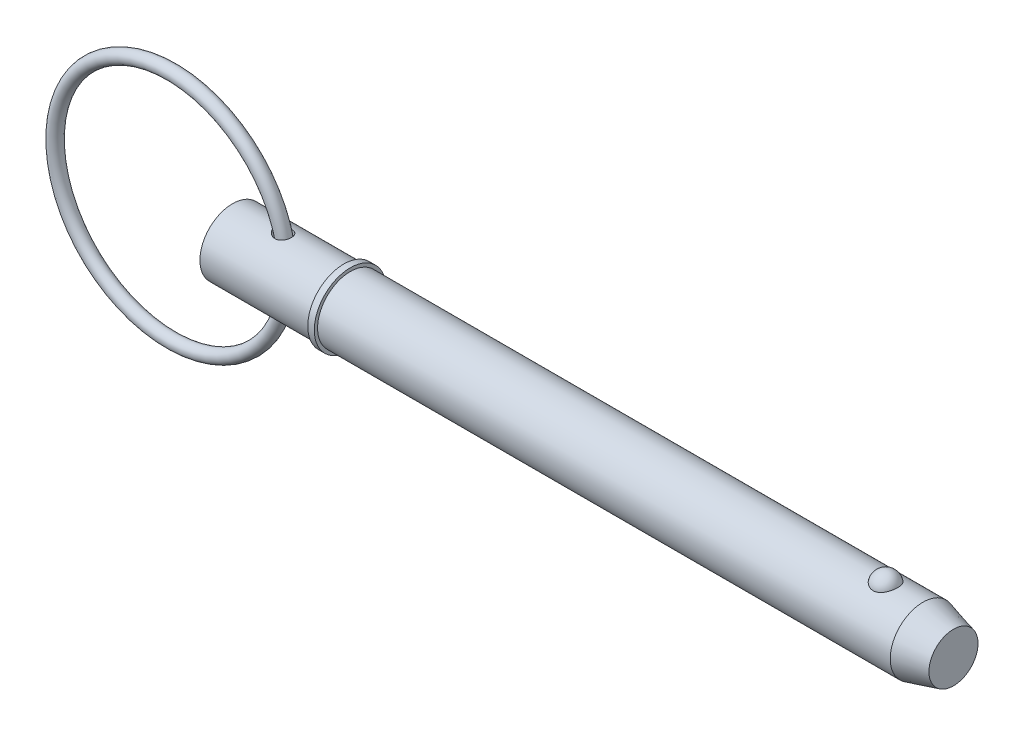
ISO-10303-21;
HEADER;
FILE_DESCRIPTION(('STEP AP214'),'2;1');
FILE_NAME('part.step','',(''),(''),'','','');
FILE_SCHEMA(('AUTOMOTIVE_DESIGN { 1 0 10303 214 1 1 1 1 }'));
ENDSEC;
DATA;
#1=APPLICATION_CONTEXT('core data for automotive mechanical design processes');
#2=APPLICATION_PROTOCOL_DEFINITION('international standard','automotive_design',2000,#1);
#3=PRODUCT_CONTEXT('',#1,'mechanical');
#4=PRODUCT('Part','Part','',(#3));
#5=PRODUCT_RELATED_PRODUCT_CATEGORY('part','',(#4));
#6=PRODUCT_DEFINITION_FORMATION('','',#4);
#7=PRODUCT_DEFINITION_CONTEXT('part definition',#1,'design');
#8=PRODUCT_DEFINITION('design','',#6,#7);
#9=PRODUCT_DEFINITION_SHAPE('','',#8);
#10=(LENGTH_UNIT() NAMED_UNIT(*) SI_UNIT(.MILLI.,.METRE.));
#11=(NAMED_UNIT(*) PLANE_ANGLE_UNIT() SI_UNIT($,.RADIAN.));
#12=(NAMED_UNIT(*) SI_UNIT($,.STERADIAN.) SOLID_ANGLE_UNIT());
#13=UNCERTAINTY_MEASURE_WITH_UNIT(LENGTH_MEASURE(1.E-05),#10,'distance_accuracy_value','');
#14=(GEOMETRIC_REPRESENTATION_CONTEXT(3) GLOBAL_UNCERTAINTY_ASSIGNED_CONTEXT((#13)) GLOBAL_UNIT_ASSIGNED_CONTEXT((#10,
#11,#12)) REPRESENTATION_CONTEXT('',''));
#15=CARTESIAN_POINT('',(0.,0.,0.));
#16=DIRECTION('',(0.,0.,1.));
#17=DIRECTION('',(1.,0.,0.));
#18=AXIS2_PLACEMENT_3D('',#15,#16,#17);
#19=CARTESIAN_POINT('',(-13.3805387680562,0.,0.));
#20=DIRECTION('',(0.,0.,1.));
#21=DIRECTION('',(1.,0.,0.));
#22=AXIS2_PLACEMENT_3D('',#19,#20,#21);
#23=TOROIDAL_SURFACE('',#22,25.4,1.429);
#24=CARTESIAN_POINT('',(13.4484612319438,0.,0.));
#25=VERTEX_POINT('',#24);
#26=VERTEX_LOOP('',#25);
#27=FACE_BOUND('',#26,.T.);
#28=ADVANCED_FACE('P0_F12',(#27),#23,.T.);
#29=CLOSED_SHELL('',(#28));
#30=MANIFOLD_SOLID_BREP('P0_B1',#29);
#31=CARTESIAN_POINT('',(0.,0.,0.));
#32=DIRECTION('',(1.,0.,0.));
#33=DIRECTION('',(0.,0.,-1.));
#34=AXIS2_PLACEMENT_3D('',#31,#32,#33);
#35=CYLINDRICAL_SURFACE('',#34,7.145);
#36=CARTESIAN_POINT('',(9.43029029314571,7.0820748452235,-0.946171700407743));
#37=CARTESIAN_POINT('',(9.49289741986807,7.07004660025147,-1.03619677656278));
#38=CARTESIAN_POINT('',(9.56370593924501,7.05703049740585,-1.12049617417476));
#39=CARTESIAN_POINT('',(9.71869321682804,7.03060933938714,-1.27585605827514));
#40=CARTESIAN_POINT('',(9.80290151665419,7.01720347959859,-1.34688652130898));
#41=CARTESIAN_POINT('',(9.98160385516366,6.99158714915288,-1.47408585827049));
#42=CARTESIAN_POINT('',(10.0760626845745,6.97937284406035,-1.53030346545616));
#43=CARTESIAN_POINT('',(10.2729508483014,6.95747410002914,-1.62697341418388));
#44=CARTESIAN_POINT('',(10.3753769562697,6.9477886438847,-1.66743209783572));
#45=CARTESIAN_POINT('',(10.5898946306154,6.93181594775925,-1.73266776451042));
#46=CARTESIAN_POINT('',(10.7022085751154,6.92567913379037,-1.75675727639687));
#47=CARTESIAN_POINT('',(10.9294935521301,6.91839634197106,-1.78523005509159));
#48=CARTESIAN_POINT('',(11.0444638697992,6.91724903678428,-1.78961856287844));
#49=CARTESIAN_POINT('',(11.2673249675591,6.92023954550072,-1.77801517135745));
#50=CARTESIAN_POINT('',(11.3752729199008,6.9241055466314,-1.7630715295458));
#51=CARTESIAN_POINT('',(11.5865707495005,6.93632220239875,-1.71437618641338));
#52=CARTESIAN_POINT('',(11.6899227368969,6.94467077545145,-1.68063321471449));
#53=CARTESIAN_POINT('',(11.8814537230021,6.96412118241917,-1.59802791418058));
#54=CARTESIAN_POINT('',(11.9701885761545,6.97498839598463,-1.55039425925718));
#55=CARTESIAN_POINT('',(12.1379548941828,6.99847346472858,-1.44066970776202));
#56=CARTESIAN_POINT('',(12.216987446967,7.01109112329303,-1.37858043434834));
#57=CARTESIAN_POINT('',(12.3614636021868,7.03632910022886,-1.24326778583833));
#58=CARTESIAN_POINT('',(12.4271729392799,7.04894297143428,-1.17032635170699));
#59=CARTESIAN_POINT('',(12.5455377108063,7.07306867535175,-1.01436746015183));
#60=CARTESIAN_POINT('',(12.5981928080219,7.08458047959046,-0.931349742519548));
#61=CARTESIAN_POINT('',(12.6896059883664,7.10535787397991,-0.75677050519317));
#62=CARTESIAN_POINT('',(12.7282356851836,7.11460247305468,-0.665139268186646));
#63=CARTESIAN_POINT('',(12.7900431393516,7.12971795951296,-0.476541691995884));
#64=CARTESIAN_POINT('',(12.8132203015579,7.13558871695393,-0.379575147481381));
#65=CARTESIAN_POINT('',(12.843715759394,7.14336270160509,-0.182249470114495));
#66=CARTESIAN_POINT('',(12.8509095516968,7.14523477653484,-0.0818698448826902));
#67=CARTESIAN_POINT('',(12.8489064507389,7.14471772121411,0.11871563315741));
#68=CARTESIAN_POINT('',(12.8397092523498,7.14232851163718,0.218921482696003));
#69=CARTESIAN_POINT('',(12.8051110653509,7.13353949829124,0.416446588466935));
#70=CARTESIAN_POINT('',(12.7796895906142,7.12713462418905,0.51376203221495));
#71=CARTESIAN_POINT('',(12.7132079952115,7.1110024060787,0.702607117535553));
#72=CARTESIAN_POINT('',(12.6721476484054,7.10127501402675,0.794136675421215));
#73=CARTESIAN_POINT('',(12.5754142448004,7.07957648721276,0.9686879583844));
#74=CARTESIAN_POINT('',(12.5197583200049,7.06760798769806,1.05171950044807));
#75=CARTESIAN_POINT('',(12.3951873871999,7.04275315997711,1.20699878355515));
#76=CARTESIAN_POINT('',(12.3262733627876,7.02986689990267,1.27924732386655));
#77=CARTESIAN_POINT('',(12.1775943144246,7.00473797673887,1.41035599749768));
#78=CARTESIAN_POINT('',(12.0979195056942,6.99249102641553,1.46931758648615));
#79=CARTESIAN_POINT('',(11.9295314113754,6.96991222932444,1.57295053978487));
#80=CARTESIAN_POINT('',(11.840819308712,6.9595801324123,1.61762377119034));
#81=CARTESIAN_POINT('',(11.6577653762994,6.94204625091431,1.69128599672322));
#82=CARTESIAN_POINT('',(11.5634812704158,6.93481718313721,1.72041226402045));
#83=CARTESIAN_POINT('',(11.3712731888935,6.92407027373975,1.76316901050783));
#84=CARTESIAN_POINT('',(11.2733489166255,6.92055273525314,1.7767982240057));
#85=CARTESIAN_POINT('',(11.0745092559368,6.91745053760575,1.78883853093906));
#86=CARTESIAN_POINT('',(10.9735737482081,6.91794816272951,1.7869312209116));
#87=CARTESIAN_POINT('',(10.7732766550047,6.92286647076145,1.76777696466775));
#88=CARTESIAN_POINT('',(10.6739155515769,6.92728833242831,1.75052540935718));
#89=CARTESIAN_POINT('',(10.4726907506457,6.93987626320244,1.69995986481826));
#90=CARTESIAN_POINT('',(10.3710860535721,6.94826759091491,1.66567223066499));
#91=CARTESIAN_POINT('',(10.1746512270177,6.96783543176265,1.5818155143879));
#92=CARTESIAN_POINT('',(10.0798244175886,6.97901329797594,1.53223900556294));
#93=CARTESIAN_POINT('',(9.89353725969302,7.00369413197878,1.41530336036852));
#94=CARTESIAN_POINT('',(9.80266896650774,7.01729943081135,1.34701798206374));
#95=CARTESIAN_POINT('',(9.63408859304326,7.0446567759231,1.19571433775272));
#96=CARTESIAN_POINT('',(9.55637809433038,7.05840883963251,1.11269430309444));
#97=CARTESIAN_POINT('',(9.41909992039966,7.083998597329,0.935821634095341));
#98=CARTESIAN_POINT('',(9.3591283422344,7.09587546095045,0.842290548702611));
#99=CARTESIAN_POINT('',(9.25811978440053,7.11649414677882,0.645207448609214));
#100=CARTESIAN_POINT('',(9.2170578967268,7.12524008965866,0.541668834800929));
#101=CARTESIAN_POINT('',(9.16044503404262,7.13745944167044,0.341322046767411));
#102=CARTESIAN_POINT('',(9.14237352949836,7.14144984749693,0.24525723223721));
#103=CARTESIAN_POINT('',(9.12416132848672,7.14547143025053,0.0513577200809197));
#104=CARTESIAN_POINT('',(9.12401221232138,7.14550446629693,-0.0464761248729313));
#105=CARTESIAN_POINT('',(9.14075660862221,7.14180686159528,-0.230866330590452));
#106=CARTESIAN_POINT('',(9.15598246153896,7.13844450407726,-0.317588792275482));
#107=CARTESIAN_POINT('',(9.20015637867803,7.1288735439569,-0.487231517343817));
#108=CARTESIAN_POINT('',(9.22909411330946,7.12266708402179,-0.570154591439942));
#109=CARTESIAN_POINT('',(9.2869632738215,7.11060500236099,-0.702183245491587));
#110=CARTESIAN_POINT('',(9.31233771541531,7.10538970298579,-0.752949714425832));
#111=CARTESIAN_POINT('',(9.36784352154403,7.09422889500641,-0.85170964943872));
#112=CARTESIAN_POINT('',(9.39797435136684,7.08828346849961,-0.899703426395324));
#113=CARTESIAN_POINT('',(9.43029029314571,7.0820748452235,-0.946171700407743));
#114=B_SPLINE_CURVE_WITH_KNOTS('',3,(#36,#37,#38,#39,#40,#41,#42,#43,#44,#45,#46,#47,#48,#49,
#50,#51,#52,#53,#54,#55,#56,#57,#58,#59,#60,#61,#62,#63,#64,#65,#66,#67,#68,#69,#70,#71,#72,#73,
#74,#75,#76,#77,#78,#79,#80,#81,#82,#83,#84,#85,#86,#87,#88,#89,#90,#91,#92,#93,#94,#95,#96,#97,
#98,#99,#100,#101,#102,#103,#104,#105,#106,#107,#108,#109,#110,#111,#112,#113),.UNSPECIFIED.,
.T.,.F.,(4,2,2,2,2,2,2,2,2,2,2,2,2,2,2,2,2,2,2,2,2,2,2,2,2,2,2,2,2,2,2,2,2,2,2,2,2,2,4),(0.,
0.330712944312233,0.662165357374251,0.992513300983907,1.32272815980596,1.66607248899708,
2.00932547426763,2.33472339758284,2.65997034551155,2.96236844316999,3.26473260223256,
3.56029376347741,3.85586255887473,4.15407251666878,4.45229395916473,4.75283038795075,
5.05337241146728,5.35429467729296,5.6552212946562,5.95579625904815,6.25634893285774,
6.55452242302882,6.85265693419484,7.14811357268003,7.44359434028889,7.74514565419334,
8.04678757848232,8.368090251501,8.68954924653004,9.03133562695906,9.37316306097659,
9.70647113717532,10.0393389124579,10.3311793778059,10.6228827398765,10.8860177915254,
11.1489549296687,11.3196783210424,11.4903825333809),.UNSPECIFIED.);
#115=CARTESIAN_POINT('',(9.43029029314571,7.0820748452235,-0.946171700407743));
#116=VERTEX_POINT('',#115);
#117=EDGE_CURVE('P1_E42',#116,#116,#114,.T.);
#118=ORIENTED_EDGE('',*,*,#117,.T.);
#119=EDGE_LOOP('',(#118));
#120=FACE_BOUND('',#119,.T.);
#121=CARTESIAN_POINT('',(0.,0.,0.));
#122=DIRECTION('',(1.,0.,0.));
#123=DIRECTION('',(0.,0.,-1.));
#124=AXIS2_PLACEMENT_3D('',#121,#122,#123);
#125=CIRCLE('',#124,7.145);
#126=CARTESIAN_POINT('',(0.,0.,-7.145));
#127=VERTEX_POINT('',#126);
#128=EDGE_CURVE('P1_E9',#127,#127,#125,.T.);
#129=ORIENTED_EDGE('',*,*,#128,.T.);
#130=EDGE_LOOP('',(#129));
#131=FACE_BOUND('',#130,.T.);
#132=CARTESIAN_POINT('',(24.271,0.,0.));
#133=DIRECTION('',(1.,0.,0.));
#134=DIRECTION('',(0.,0.,-1.));
#135=AXIS2_PLACEMENT_3D('',#132,#133,#134);
#136=CIRCLE('',#135,7.145);
#137=CARTESIAN_POINT('',(24.271,0.,-7.145));
#138=VERTEX_POINT('',#137);
#139=EDGE_CURVE('P1_E25',#138,#138,#136,.T.);
#140=ORIENTED_EDGE('',*,*,#139,.F.);
#141=EDGE_LOOP('',(#140));
#142=FACE_BOUND('',#141,.T.);
#143=CARTESIAN_POINT('',(9.43029029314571,-7.0820748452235,-0.946171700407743));
#144=CARTESIAN_POINT('',(9.37760063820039,-7.09219753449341,-0.870403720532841));
#145=CARTESIAN_POINT('',(9.33068640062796,-7.10162619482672,-0.790535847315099));
#146=CARTESIAN_POINT('',(9.25028000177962,-7.11818229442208,-0.624083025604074));
#147=CARTESIAN_POINT('',(9.21677847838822,-7.12531133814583,-0.537502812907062));
#148=CARTESIAN_POINT('',(9.16475883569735,-7.13651886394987,-0.359324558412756));
#149=CARTESIAN_POINT('',(9.14630423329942,-7.14058440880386,-0.267706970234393));
#150=CARTESIAN_POINT('',(9.12573334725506,-7.14512216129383,-0.0825612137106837));
#151=CARTESIAN_POINT('',(9.12361335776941,-7.1455951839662,0.0109665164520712));
#152=CARTESIAN_POINT('',(9.13548667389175,-7.14296952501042,0.191627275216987));
#153=CARTESIAN_POINT('',(9.14858103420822,-7.14007009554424,0.278824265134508));
#154=CARTESIAN_POINT('',(9.18869656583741,-7.1313430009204,0.449782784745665));
#155=CARTESIAN_POINT('',(9.21571947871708,-7.1255149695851,0.533543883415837));
#156=CARTESIAN_POINT('',(9.282939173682,-7.11140544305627,0.696984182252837));
#157=CARTESIAN_POINT('',(9.32334793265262,-7.10308469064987,0.7765721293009));
#158=CARTESIAN_POINT('',(9.41555290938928,-7.08481187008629,0.928623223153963));
#159=CARTESIAN_POINT('',(9.4673531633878,-7.07485922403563,1.00108383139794));
#160=CARTESIAN_POINT('',(9.58690514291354,-7.05302654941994,1.14530893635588));
#161=CARTESIAN_POINT('',(9.65578345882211,-7.04105486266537,1.21612477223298));
#162=CARTESIAN_POINT('',(9.80342908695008,-7.01727063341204,1.34660507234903));
#163=CARTESIAN_POINT('',(9.88220203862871,-7.00545818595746,1.40626312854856));
#164=CARTESIAN_POINT('',(10.0573217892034,-6.98177399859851,1.51973713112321));
#165=CARTESIAN_POINT('',(10.1546474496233,-6.9700532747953,1.57208037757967));
#166=CARTESIAN_POINT('',(10.3567277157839,-6.94950828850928,1.66055104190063));
#167=CARTESIAN_POINT('',(10.4614845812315,-6.94068491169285,1.69667350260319));
#168=CARTESIAN_POINT('',(10.6792116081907,-6.92685379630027,1.75230777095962));
#169=CARTESIAN_POINT('',(10.7923373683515,-6.92197732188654,1.77125049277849));
#170=CARTESIAN_POINT('',(11.0202699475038,-6.91736328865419,1.78919210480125));
#171=CARTESIAN_POINT('',(11.1350759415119,-6.91762328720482,1.78820047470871));
#172=CARTESIAN_POINT('',(11.355627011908,-6.92328130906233,1.76615765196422));
#173=CARTESIAN_POINT('',(11.4615007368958,-6.92836826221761,1.74632083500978));
#174=CARTESIAN_POINT('',(11.6678083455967,-6.94272508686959,1.68833625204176));
#175=CARTESIAN_POINT('',(11.7682443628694,-6.9519933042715,1.65019572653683));
#176=CARTESIAN_POINT('',(11.9539217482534,-6.97285816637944,1.55957439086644));
#177=CARTESIAN_POINT('',(12.0397280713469,-6.98426147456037,1.50820229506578));
#178=CARTESIAN_POINT('',(12.2011249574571,-7.00842344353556,1.39160266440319));
#179=CARTESIAN_POINT('',(12.276716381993,-7.0211819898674,1.32637629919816));
#180=CARTESIAN_POINT('',(12.4144868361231,-7.04639315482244,1.18508369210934));
#181=CARTESIAN_POINT('',(12.4768620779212,-7.05884739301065,1.10920872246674));
#182=CARTESIAN_POINT('',(12.5881779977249,-7.08230185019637,0.947973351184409));
#183=CARTESIAN_POINT('',(12.6371182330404,-7.09330202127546,0.862612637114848));
#184=CARTESIAN_POINT('',(12.7208404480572,-7.11277016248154,0.68387168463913));
#185=CARTESIAN_POINT('',(12.7554736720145,-7.12121129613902,0.590418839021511));
#186=CARTESIAN_POINT('',(12.8090653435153,-7.13450309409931,0.398877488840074));
#187=CARTESIAN_POINT('',(12.8280232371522,-7.13935363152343,0.300788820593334));
#188=CARTESIAN_POINT('',(12.8499077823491,-7.14496695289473,0.102058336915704));
#189=CARTESIAN_POINT('',(12.8527265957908,-7.14570223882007,0.00140385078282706));
#190=CARTESIAN_POINT('',(12.8419792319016,-7.14293198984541,-0.198968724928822));
#191=CARTESIAN_POINT('',(12.8284127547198,-7.13942637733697,-0.298686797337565));
#192=CARTESIAN_POINT('',(12.7851853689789,-7.12854635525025,-0.494442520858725));
#193=CARTESIAN_POINT('',(12.7555107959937,-7.12116866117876,-0.590476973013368));
#194=CARTESIAN_POINT('',(12.6807437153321,-7.10334272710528,-0.776042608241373));
#195=CARTESIAN_POINT('',(12.6356510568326,-7.09289445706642,-0.865573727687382));
#196=CARTESIAN_POINT('',(12.5312128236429,-7.07009703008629,-1.03541867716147));
#197=CARTESIAN_POINT('',(12.4718917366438,-7.0577511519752,-1.11574799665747));
#198=CARTESIAN_POINT('',(12.3404461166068,-7.03252701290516,-1.26504204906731));
#199=CARTESIAN_POINT('',(12.2683227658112,-7.01964880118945,-1.3340078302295));
#200=CARTESIAN_POINT('',(12.1139052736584,-6.99493588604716,-1.45803732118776));
#201=CARTESIAN_POINT('',(12.031708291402,-6.98309284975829,-1.51322032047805));
#202=CARTESIAN_POINT('',(11.858962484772,-6.96164945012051,-1.60900039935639));
#203=CARTESIAN_POINT('',(11.7684146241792,-6.95204882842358,-1.6495991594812));
#204=CARTESIAN_POINT('',(11.5822744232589,-6.93618392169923,-1.71508374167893));
#205=CARTESIAN_POINT('',(11.4867225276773,-6.92989640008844,-1.74007923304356));
#206=CARTESIAN_POINT('',(11.292703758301,-6.92114809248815,-1.77455680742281));
#207=CARTESIAN_POINT('',(11.1942365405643,-6.91868775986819,-1.7840370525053));
#208=CARTESIAN_POINT('',(10.9943797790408,-6.91771041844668,-1.78782317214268));
#209=CARTESIAN_POINT('',(10.8929824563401,-6.9193005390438,-1.78171679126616));
#210=CARTESIAN_POINT('',(10.6924353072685,-6.92632816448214,-1.75419409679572));
#211=CARTESIAN_POINT('',(10.5932861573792,-6.93176681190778,-1.73277323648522));
#212=CARTESIAN_POINT('',(10.3927770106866,-6.94630717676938,-1.67356884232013));
#213=CARTESIAN_POINT('',(10.2917367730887,-6.95563581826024,-1.63475796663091));
#214=CARTESIAN_POINT('',(10.0971768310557,-6.97681957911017,-1.54184188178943));
#215=CARTESIAN_POINT('',(10.0036623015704,-6.9886764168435,-1.48772626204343));
#216=CARTESIAN_POINT('',(9.82098935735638,-7.01440230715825,-1.36146688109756));
#217=CARTESIAN_POINT('',(9.73247440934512,-7.0283510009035,-1.28840361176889));
#218=CARTESIAN_POINT('',(9.56978695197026,-7.05591334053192,-1.12770855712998));
#219=CARTESIAN_POINT('',(9.49560170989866,-7.06952727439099,-1.0400898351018));
#220=CARTESIAN_POINT('',(9.43029029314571,-7.0820748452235,-0.946171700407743));
#221=B_SPLINE_CURVE_WITH_KNOTS('',3,(#143,#144,#145,#146,#147,#148,#149,#150,#151,#152,#153,
#154,#155,#156,#157,#158,#159,#160,#161,#162,#163,#164,#165,#166,#167,#168,#169,#170,#171,#172,
#173,#174,#175,#176,#177,#178,#179,#180,#181,#182,#183,#184,#185,#186,#187,#188,#189,#190,#191,
#192,#193,#194,#195,#196,#197,#198,#199,#200,#201,#202,#203,#204,#205,#206,#207,#208,#209,#210,
#211,#212,#213,#214,#215,#216,#217,#218,#219,#220),.UNSPECIFIED.,.T.,.F.,(4,2,2,2,2,2,2,2,2,2,2,
2,2,2,2,2,2,2,2,2,2,2,2,2,2,2,2,2,2,2,2,2,2,2,2,2,2,2,4),(0.,0.278197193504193,
0.556199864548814,0.835370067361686,1.11447693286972,1.37789669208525,1.64134939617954,
1.9091912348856,2.17712812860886,2.4744625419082,2.77196719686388,3.10386520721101,
3.43586457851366,3.77849767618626,4.1209678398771,4.44276705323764,4.76443907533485,
5.06494526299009,5.36542609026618,5.6610728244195,5.95672929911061,6.25538683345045,
6.5540549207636,6.85471634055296,7.15538326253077,7.45630563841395,7.75723095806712,
8.05764204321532,8.35802540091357,8.65571107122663,8.95336242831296,9.24889743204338,
9.54446744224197,9.84793560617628,10.1514939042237,10.4760045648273,10.8007364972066,
11.1458836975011,11.4907227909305),.UNSPECIFIED.);
#222=CARTESIAN_POINT('',(9.43029029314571,-7.0820748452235,-0.946171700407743));
#223=VERTEX_POINT('',#222);
#224=EDGE_CURVE('P1_E17',#223,#223,#221,.T.);
#225=ORIENTED_EDGE('',*,*,#224,.T.);
#226=EDGE_LOOP('',(#225));
#227=FACE_BOUND('',#226,.T.);
#228=ADVANCED_FACE('P1_F13',(#120,#131,#142,#227),#35,.T.);
#229=CARTESIAN_POINT('',(0.,0.,0.));
#230=DIRECTION('',(1.,0.,0.));
#231=DIRECTION('',(0.,0.,-1.));
#232=AXIS2_PLACEMENT_3D('',#229,#230,#231);
#233=CYLINDRICAL_SURFACE('',#232,7.145);
#234=CARTESIAN_POINT('',(150.78362424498,0.,0.));
#235=DIRECTION('',(1.,0.,0.));
#236=DIRECTION('',(0.,0.,-1.));
#237=AXIS2_PLACEMENT_3D('',#234,#235,#236);
#238=CIRCLE('',#237,7.145);
#239=CARTESIAN_POINT('',(150.78362424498,0.,-7.145));
#240=VERTEX_POINT('',#239);
#241=EDGE_CURVE('P1_E99',#240,#240,#238,.T.);
#242=ORIENTED_EDGE('',*,*,#241,.F.);
#243=EDGE_LOOP('',(#242));
#244=FACE_BOUND('',#243,.T.);
#245=CARTESIAN_POINT('',(25.7,0.,0.));
#246=DIRECTION('',(1.,0.,0.));
#247=DIRECTION('',(0.,0.,-1.));
#248=AXIS2_PLACEMENT_3D('',#245,#246,#247);
#249=CIRCLE('',#248,7.145);
#250=CARTESIAN_POINT('',(25.7,0.,-7.145));
#251=VERTEX_POINT('',#250);
#252=EDGE_CURVE('P1_E96',#251,#251,#249,.T.);
#253=ORIENTED_EDGE('',*,*,#252,.T.);
#254=EDGE_LOOP('',(#253));
#255=FACE_BOUND('',#254,.T.);
#256=CARTESIAN_POINT('',(142.639503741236,6.6032862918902,2.72903557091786));
#257=CARTESIAN_POINT('',(142.498315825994,6.60329644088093,2.72902496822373));
#258=CARTESIAN_POINT('',(142.356883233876,6.60799490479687,2.71772840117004));
#259=CARTESIAN_POINT('',(142.077955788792,6.62628236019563,2.67281935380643));
#260=CARTESIAN_POINT('',(141.940472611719,6.63989534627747,2.63914664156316));
#261=CARTESIAN_POINT('',(141.673889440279,6.67440775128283,2.5505964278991));
#262=CARTESIAN_POINT('',(141.544768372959,6.69528793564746,2.49577486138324));
#263=CARTESIAN_POINT('',(141.297869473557,6.74205585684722,2.36651799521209));
#264=CARTESIAN_POINT('',(141.180086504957,6.76794130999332,2.29209163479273));
#265=CARTESIAN_POINT('',(140.95516710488,6.82286177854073,2.1231293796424));
#266=CARTESIAN_POINT('',(140.848440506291,6.85196655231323,2.02807107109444));
#267=CARTESIAN_POINT('',(140.651918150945,6.90970232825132,1.82167822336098));
#268=CARTESIAN_POINT('',(140.562127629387,6.93833318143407,1.71033867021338));
#269=CARTESIAN_POINT('',(140.397667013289,6.99351679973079,1.46891951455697));
#270=CARTESIAN_POINT('',(140.323844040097,7.01992110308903,1.33822781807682));
#271=CARTESIAN_POINT('',(140.198088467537,7.06643385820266,1.06566567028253));
#272=CARTESIAN_POINT('',(140.14615735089,7.08654188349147,0.923794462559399));
#273=CARTESIAN_POINT('',(140.064732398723,7.11862399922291,0.630993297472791));
#274=CARTESIAN_POINT('',(140.035516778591,7.13049704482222,0.479974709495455));
#275=CARTESIAN_POINT('',(140.001174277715,7.14449484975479,0.174782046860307));
#276=CARTESIAN_POINT('',(139.996046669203,7.14661990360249,0.0206080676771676));
#277=CARTESIAN_POINT('',(140.009938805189,7.14092465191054,-0.285506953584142));
#278=CARTESIAN_POINT('',(140.028810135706,7.1331654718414,-0.437455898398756));
#279=CARTESIAN_POINT('',(140.090062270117,7.10859076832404,-0.73577860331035));
#280=CARTESIAN_POINT('',(140.132443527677,7.0917750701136,-0.882152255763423));
#281=CARTESIAN_POINT('',(140.239934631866,7.05076716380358,-1.16543149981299));
#282=CARTESIAN_POINT('',(140.305075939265,7.02656475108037,-1.30232366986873));
#283=CARTESIAN_POINT('',(140.456759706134,6.97329145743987,-1.56265907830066));
#284=CARTESIAN_POINT('',(140.543303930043,6.94422017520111,-1.68610120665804));
#285=CARTESIAN_POINT('',(140.736465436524,6.88415108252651,-1.91671004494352));
#286=CARTESIAN_POINT('',(140.843180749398,6.85314438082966,-2.02379244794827));
#287=CARTESIAN_POINT('',(141.073974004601,6.79282069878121,-2.21787433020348));
#288=CARTESIAN_POINT('',(141.198050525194,6.76350358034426,-2.30487545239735));
#289=CARTESIAN_POINT('',(141.457678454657,6.71060580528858,-2.45458647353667));
#290=CARTESIAN_POINT('',(141.592938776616,6.68691885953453,-2.51776240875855));
#291=CARTESIAN_POINT('',(141.873277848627,6.64741247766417,-2.62030218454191));
#292=CARTESIAN_POINT('',(142.018352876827,6.63159007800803,-2.65967499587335));
#293=CARTESIAN_POINT('',(142.306347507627,6.61038594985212,-2.71193301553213));
#294=CARTESIAN_POINT('',(142.44900807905,6.60451880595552,-2.72605165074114));
#295=CARTESIAN_POINT('',(142.73480047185,6.60240611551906,-2.73116688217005));
#296=CARTESIAN_POINT('',(142.877932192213,6.60615862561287,-2.72216814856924));
#297=CARTESIAN_POINT('',(143.155848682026,6.62256094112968,-2.68200435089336));
#298=CARTESIAN_POINT('',(143.290754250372,6.63492533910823,-2.65154998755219));
#299=CARTESIAN_POINT('',(143.55332009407,6.66687445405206,-2.57015684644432));
#300=CARTESIAN_POINT('',(143.68097978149,6.68645975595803,-2.51921640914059));
#301=CARTESIAN_POINT('',(143.928577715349,6.731272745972,-2.39693610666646));
#302=CARTESIAN_POINT('',(144.048287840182,6.75661381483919,-2.32517694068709));
#303=CARTESIAN_POINT('',(144.274159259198,6.81006003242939,-2.16363812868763));
#304=CARTESIAN_POINT('',(144.380317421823,6.83816581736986,-2.07385432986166));
#305=CARTESIAN_POINT('',(144.581862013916,6.89580469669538,-1.87357235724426));
#306=CARTESIAN_POINT('',(144.676440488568,6.92533863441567,-1.76226074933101));
#307=CARTESIAN_POINT('',(144.846332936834,6.98139526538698,-1.52511696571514));
#308=CARTESIAN_POINT('',(144.921643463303,7.0079174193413,-1.39928219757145));
#309=CARTESIAN_POINT('',(145.053595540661,7.05607625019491,-1.13215977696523));
#310=CARTESIAN_POINT('',(145.109568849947,7.07753119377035,-0.990508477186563));
#311=CARTESIAN_POINT('',(145.198296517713,7.11222355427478,-0.699154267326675));
#312=CARTESIAN_POINT('',(145.231050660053,7.12546089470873,-0.549451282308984));
#313=CARTESIAN_POINT('',(145.272689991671,7.1423758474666,-0.246120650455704));
#314=CARTESIAN_POINT('',(145.281558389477,7.14604673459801,-0.0924903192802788));
#315=CARTESIAN_POINT('',(145.275194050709,7.14343510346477,0.214181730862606));
#316=CARTESIAN_POINT('',(145.259961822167,7.13715279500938,0.367223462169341));
#317=CARTESIAN_POINT('',(145.205845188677,7.1153294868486,0.667595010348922));
#318=CARTESIAN_POINT('',(145.167077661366,7.09983424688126,0.814949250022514));
#319=CARTESIAN_POINT('',(145.066770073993,7.06119140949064,1.10063221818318));
#320=CARTESIAN_POINT('',(145.005228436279,7.03804328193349,1.23896032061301));
#321=CARTESIAN_POINT('',(144.860207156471,6.98632429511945,1.50352300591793));
#322=CARTESIAN_POINT('',(144.776606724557,6.95772382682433,1.62968561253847));
#323=CARTESIAN_POINT('',(144.58938046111,6.89823072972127,1.86554304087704));
#324=CARTESIAN_POINT('',(144.485755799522,6.86733823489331,1.97523882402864));
#325=CARTESIAN_POINT('',(144.261076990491,6.80676456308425,2.174822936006));
#326=CARTESIAN_POINT('',(144.140067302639,6.7770805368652,2.26476035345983));
#327=CARTESIAN_POINT('',(143.883340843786,6.7223050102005,2.42252989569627));
#328=CARTESIAN_POINT('',(143.74761851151,6.69721525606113,2.49035362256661));
#329=CARTESIAN_POINT('',(143.470402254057,6.65552591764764,2.59967646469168));
#330=CARTESIAN_POINT('',(143.329281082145,6.63865794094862,2.64202017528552));
#331=CARTESIAN_POINT('',(143.041444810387,6.6142503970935,2.70255841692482));
#332=CARTESIAN_POINT('',(142.894748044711,6.60668259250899,2.72082606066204));
#333=CARTESIAN_POINT('',(142.711679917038,6.60358754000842,2.7283033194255));
#334=CARTESIAN_POINT('',(142.675599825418,6.60328369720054,2.72903828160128));
#335=CARTESIAN_POINT('',(142.639503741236,6.6032862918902,2.72903557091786));
#336=B_SPLINE_CURVE_WITH_KNOTS('',3,(#256,#257,#258,#259,#260,#261,#262,#263,#264,#265,#266,
#267,#268,#269,#270,#271,#272,#273,#274,#275,#276,#277,#278,#279,#280,#281,#282,#283,#284,#285,
#286,#287,#288,#289,#290,#291,#292,#293,#294,#295,#296,#297,#298,#299,#300,#301,#302,#303,#304,
#305,#306,#307,#308,#309,#310,#311,#312,#313,#314,#315,#316,#317,#318,#319,#320,#321,#322,#323,
#324,#325,#326,#327,#328,#329,#330,#331,#332,#333,#334,#335),.UNSPECIFIED.,.T.,.F.,(4,2,2,2,2,2,
2,2,2,2,2,2,2,2,2,2,2,2,2,2,2,2,2,2,2,2,2,2,2,2,2,2,2,2,2,2,2,2,2,4),(0.,0.423468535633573,
0.848081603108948,1.2715792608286,1.69488414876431,2.13051395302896,2.56627819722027,
3.02136706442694,3.4764867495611,3.93709649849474,4.39769233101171,4.8554535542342,
5.31322361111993,5.77162895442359,6.23007210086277,6.69080337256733,7.1514969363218,
7.60264329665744,8.05361952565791,8.48189729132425,8.91008854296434,9.32472524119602,
9.73939553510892,10.1630783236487,10.5868588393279,11.031907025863,11.4770347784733,
11.9362874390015,12.3955443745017,12.8551240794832,13.3146940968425,13.7720003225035,
14.2293382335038,14.6892343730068,15.1491036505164,15.6078171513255,16.0667046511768,
16.5093965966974,16.9507410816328,17.0590049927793),.UNSPECIFIED.);
#337=CARTESIAN_POINT('',(142.639503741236,6.6032862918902,2.72903557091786));
#338=VERTEX_POINT('',#337);
#339=EDGE_CURVE('P1_E34',#338,#338,#336,.T.);
#340=ORIENTED_EDGE('',*,*,#339,.T.);
#341=EDGE_LOOP('',(#340));
#342=FACE_BOUND('',#341,.T.);
#343=ADVANCED_FACE('P1_F46',(#244,#255,#342),#233,.T.);
#344=CARTESIAN_POINT('',(0.,0.,0.));
#345=DIRECTION('',(-1.,0.,0.));
#346=DIRECTION('',(0.,0.,1.));
#347=AXIS2_PLACEMENT_3D('',#344,#345,#346);
#348=PLANE('',#347);
#349=ORIENTED_EDGE('',*,*,#128,.F.);
#350=EDGE_LOOP('',(#349));
#351=FACE_BOUND('',#350,.T.);
#352=ADVANCED_FACE('P1_F15',(#351),#348,.T.);
#353=CARTESIAN_POINT('',(24.271,7.145,0.));
#354=DIRECTION('',(-1.,0.,0.));
#355=DIRECTION('',(0.,0.,1.));
#356=AXIS2_PLACEMENT_3D('',#353,#354,#355);
#357=PLANE('',#356);
#358=ORIENTED_EDGE('',*,*,#139,.T.);
#359=EDGE_LOOP('',(#358));
#360=FACE_BOUND('',#359,.T.);
#361=CARTESIAN_POINT('',(24.271,0.,0.));
#362=DIRECTION('',(1.,0.,0.));
#363=DIRECTION('',(0.,0.,-1.));
#364=AXIS2_PLACEMENT_3D('',#361,#362,#363);
#365=CIRCLE('',#364,7.8595);
#366=CARTESIAN_POINT('',(24.271,0.,-7.8595));
#367=VERTEX_POINT('',#366);
#368=EDGE_CURVE('P1_E30',#367,#367,#365,.T.);
#369=ORIENTED_EDGE('',*,*,#368,.F.);
#370=EDGE_LOOP('',(#369));
#371=FACE_BOUND('',#370,.T.);
#372=ADVANCED_FACE('P1_F81',(#360,#371),#357,.T.);
#373=CARTESIAN_POINT('',(0.,0.,0.));
#374=DIRECTION('',(1.,0.,0.));
#375=DIRECTION('',(0.,0.,-1.));
#376=AXIS2_PLACEMENT_3D('',#373,#374,#375);
#377=CYLINDRICAL_SURFACE('',#376,7.8595);
#378=ORIENTED_EDGE('',*,*,#368,.T.);
#379=EDGE_LOOP('',(#378));
#380=FACE_BOUND('',#379,.T.);
#381=CARTESIAN_POINT('',(25.7,0.,0.));
#382=DIRECTION('',(1.,0.,0.));
#383=DIRECTION('',(0.,0.,-1.));
#384=AXIS2_PLACEMENT_3D('',#381,#382,#383);
#385=CIRCLE('',#384,7.8595);
#386=CARTESIAN_POINT('',(25.7,0.,-7.8595));
#387=VERTEX_POINT('',#386);
#388=EDGE_CURVE('P1_E95',#387,#387,#385,.T.);
#389=ORIENTED_EDGE('',*,*,#388,.F.);
#390=EDGE_LOOP('',(#389));
#391=FACE_BOUND('',#390,.T.);
#392=ADVANCED_FACE('P1_F68',(#380,#391),#377,.T.);
#393=CARTESIAN_POINT('',(25.7,7.8595,0.));
#394=DIRECTION('',(1.,0.,0.));
#395=DIRECTION('',(0.,0.,-1.));
#396=AXIS2_PLACEMENT_3D('',#393,#394,#395);
#397=PLANE('',#396);
#398=ORIENTED_EDGE('',*,*,#388,.T.);
#399=EDGE_LOOP('',(#398));
#400=FACE_BOUND('',#399,.T.);
#401=ORIENTED_EDGE('',*,*,#252,.F.);
#402=EDGE_LOOP('',(#401));
#403=FACE_BOUND('',#402,.T.);
#404=ADVANCED_FACE('P1_F62',(#400,#403),#397,.T.);
#405=CARTESIAN_POINT('',(157.45,0.,0.));
#406=DIRECTION('',(-1.,0.,0.));
#407=DIRECTION('',(0.,0.,1.));
#408=AXIS2_PLACEMENT_3D('',#405,#406,#407);
#409=CONICAL_SURFACE('',#408,5.35875000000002,0.26179938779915);
#410=ORIENTED_EDGE('',*,*,#241,.T.);
#411=EDGE_LOOP('',(#410));
#412=FACE_BOUND('',#411,.T.);
#413=CARTESIAN_POINT('',(157.45,0.,0.));
#414=DIRECTION('',(1.,0.,0.));
#415=DIRECTION('',(0.,0.,-1.));
#416=AXIS2_PLACEMENT_3D('',#413,#414,#415);
#417=CIRCLE('',#416,5.35875000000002);
#418=CARTESIAN_POINT('',(157.45,0.,-5.35875000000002));
#419=VERTEX_POINT('',#418);
#420=EDGE_CURVE('P1_E41',#419,#419,#417,.T.);
#421=ORIENTED_EDGE('',*,*,#420,.F.);
#422=EDGE_LOOP('',(#421));
#423=FACE_BOUND('',#422,.T.);
#424=ADVANCED_FACE('P1_F59',(#412,#423),#409,.T.);
#425=CARTESIAN_POINT('',(157.45,5.35875000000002,0.));
#426=DIRECTION('',(1.,0.,0.));
#427=DIRECTION('',(0.,0.,-1.));
#428=AXIS2_PLACEMENT_3D('',#425,#426,#427);
#429=PLANE('',#428);
#430=ORIENTED_EDGE('',*,*,#420,.T.);
#431=EDGE_LOOP('',(#430));
#432=FACE_BOUND('',#431,.T.);
#433=ADVANCED_FACE('P1_F55',(#432),#429,.T.);
#434=CARTESIAN_POINT('',(142.639503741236,6.4305,0.));
#435=DIRECTION('',(-1.,0.,0.));
#436=DIRECTION('',(0.,1.,0.));
#437=AXIS2_PLACEMENT_3D('',#434,#435,#436);
#438=SPHERICAL_SURFACE('',#437,2.73450000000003);
#439=ORIENTED_EDGE('',*,*,#339,.F.);
#440=EDGE_LOOP('',(#439));
#441=FACE_BOUND('',#440,.T.);
#442=ADVANCED_FACE('P1_F50',(#441),#438,.T.);
#443=CARTESIAN_POINT('',(-13.3805387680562,0.,0.));
#444=DIRECTION('',(0.,0.,1.));
#445=DIRECTION('',(1.,0.,0.));
#446=AXIS2_PLACEMENT_3D('',#443,#444,#445);
#447=TOROIDAL_SURFACE('',#446,25.4,1.78625);
#448=ORIENTED_EDGE('',*,*,#224,.F.);
#449=EDGE_LOOP('',(#448));
#450=FACE_BOUND('',#449,.T.);
#451=ORIENTED_EDGE('',*,*,#117,.F.);
#452=EDGE_LOOP('',(#451));
#453=FACE_BOUND('',#452,.T.);
#454=ADVANCED_FACE('P1_F54',(#450,#453),#447,.F.);
#455=CLOSED_SHELL('',(#228,#343,#352,#372,#392,#404,#424,#433,#442,#454));
#456=MANIFOLD_SOLID_BREP('P1_B1',#455);
#457=ADVANCED_BREP_SHAPE_REPRESENTATION('',(#18,#30,#456),#14);
#458=SHAPE_DEFINITION_REPRESENTATION(#9,#457);
ENDSEC;
END-ISO-10303-21;
